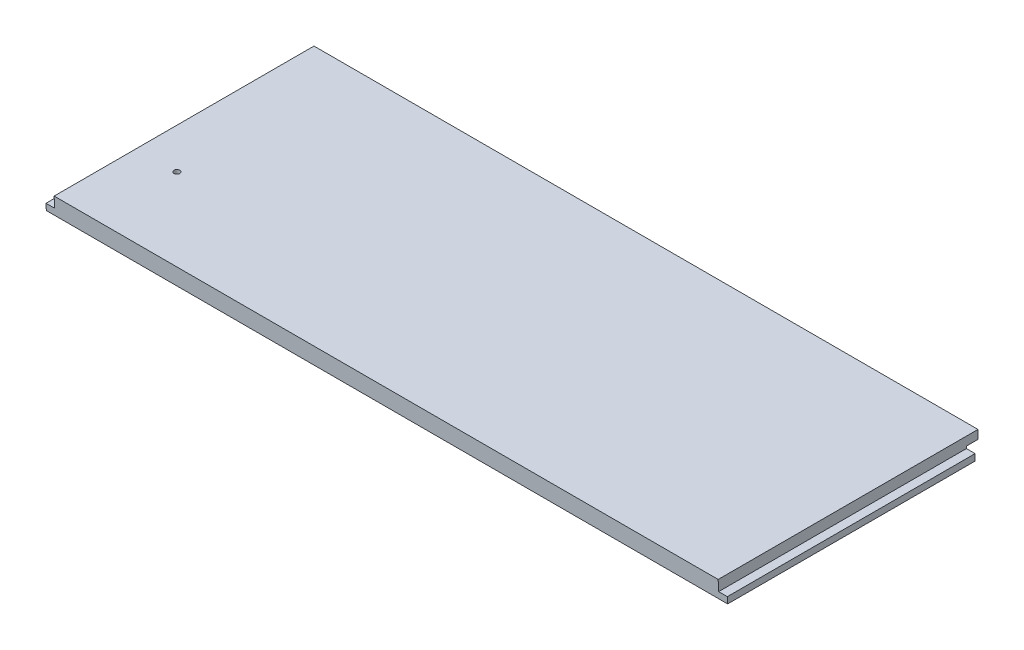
ISO-10303-21;
HEADER;
FILE_DESCRIPTION(('STEP AP214'),'2;1');
FILE_NAME('part.step','',(''),(''),'','','');
FILE_SCHEMA(('AUTOMOTIVE_DESIGN { 1 0 10303 214 1 1 1 1 }'));
ENDSEC;
DATA;
#1=APPLICATION_CONTEXT('core data for automotive mechanical design processes');
#2=APPLICATION_PROTOCOL_DEFINITION('international standard','automotive_design',2000,#1);
#3=PRODUCT_CONTEXT('',#1,'mechanical');
#4=PRODUCT('Part','Part','',(#3));
#5=PRODUCT_RELATED_PRODUCT_CATEGORY('part','',(#4));
#6=PRODUCT_DEFINITION_FORMATION('','',#4);
#7=PRODUCT_DEFINITION_CONTEXT('part definition',#1,'design');
#8=PRODUCT_DEFINITION('design','',#6,#7);
#9=PRODUCT_DEFINITION_SHAPE('','',#8);
#10=(LENGTH_UNIT() NAMED_UNIT(*) SI_UNIT(.MILLI.,.METRE.));
#11=(NAMED_UNIT(*) PLANE_ANGLE_UNIT() SI_UNIT($,.RADIAN.));
#12=(NAMED_UNIT(*) SI_UNIT($,.STERADIAN.) SOLID_ANGLE_UNIT());
#13=UNCERTAINTY_MEASURE_WITH_UNIT(LENGTH_MEASURE(1.E-05),#10,'distance_accuracy_value','');
#14=(GEOMETRIC_REPRESENTATION_CONTEXT(3) GLOBAL_UNCERTAINTY_ASSIGNED_CONTEXT((#13)) GLOBAL_UNIT_ASSIGNED_CONTEXT((#10,
#11,#12)) REPRESENTATION_CONTEXT('',''));
#15=CARTESIAN_POINT('',(0.,0.,0.));
#16=DIRECTION('',(0.,0.,1.));
#17=DIRECTION('',(1.,0.,0.));
#18=AXIS2_PLACEMENT_3D('',#15,#16,#17);
#19=CARTESIAN_POINT('',(374.65,-19.05,142.875));
#20=DIRECTION('',(1.,0.,0.));
#21=DIRECTION('',(0.,0.,-1.));
#22=AXIS2_PLACEMENT_3D('',#19,#20,#21);
#23=PLANE('',#22);
#24=DIRECTION('',(0.,-1.,0.));
#25=VECTOR('',#24,1.);
#26=CARTESIAN_POINT('',(374.65,-19.05,-130.175));
#27=LINE('',#26,#25);
#28=CARTESIAN_POINT('',(374.65,-11.90625,-130.175));
#29=VERTEX_POINT('',#28);
#30=CARTESIAN_POINT('',(374.65,-19.05,-130.175));
#31=VERTEX_POINT('',#30);
#32=EDGE_CURVE('E114',#29,#31,#27,.T.);
#33=ORIENTED_EDGE('',*,*,#32,.F.);
#34=DIRECTION('',(0.,0.,-1.));
#35=VECTOR('',#34,1.);
#36=CARTESIAN_POINT('',(374.65,-11.90625,142.875));
#37=LINE('',#36,#35);
#38=CARTESIAN_POINT('',(374.65,-11.90625,142.306746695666));
#39=VERTEX_POINT('',#38);
#40=EDGE_CURVE('E156',#39,#29,#37,.T.);
#41=ORIENTED_EDGE('',*,*,#40,.F.);
#42=DIRECTION('',(0.,-0.998862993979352,-0.0476730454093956));
#43=VECTOR('',#42,1.);
#44=CARTESIAN_POINT('',(374.65,-19.0067046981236,141.967861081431));
#45=LINE('',#44,#43);
#46=CARTESIAN_POINT('',(374.65,-19.05,141.965794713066));
#47=VERTEX_POINT('',#46);
#48=EDGE_CURVE('E145',#39,#47,#45,.T.);
#49=ORIENTED_EDGE('',*,*,#48,.T.);
#50=DIRECTION('',(0.,0.,-1.));
#51=VECTOR('',#50,1.);
#52=CARTESIAN_POINT('',(374.65,-19.05,142.875));
#53=LINE('',#52,#51);
#54=EDGE_CURVE('E135',#47,#31,#53,.T.);
#55=ORIENTED_EDGE('',*,*,#54,.T.);
#56=EDGE_LOOP('',(#33,#41,#49,#55));
#57=FACE_BOUND('',#56,.T.);
#58=ADVANCED_FACE('F33',(#57),#23,.T.);
#59=CARTESIAN_POINT('',(-374.65,-19.05,142.875));
#60=DIRECTION('',(-1.,0.,0.));
#61=DIRECTION('',(0.,0.,1.));
#62=AXIS2_PLACEMENT_3D('',#59,#60,#61);
#63=PLANE('',#62);
#64=DIRECTION('',(0.,-1.,0.));
#65=VECTOR('',#64,1.);
#66=CARTESIAN_POINT('',(-374.65,-19.05,-130.175));
#67=LINE('',#66,#65);
#68=CARTESIAN_POINT('',(-374.65,-11.90625,-130.175));
#69=VERTEX_POINT('',#68);
#70=CARTESIAN_POINT('',(-374.65,-19.05,-130.175));
#71=VERTEX_POINT('',#70);
#72=EDGE_CURVE('E111',#69,#71,#67,.T.);
#73=ORIENTED_EDGE('',*,*,#72,.T.);
#74=DIRECTION('',(0.,0.,1.));
#75=VECTOR('',#74,1.);
#76=CARTESIAN_POINT('',(-374.65,-19.05,142.875));
#77=LINE('',#76,#75);
#78=CARTESIAN_POINT('',(-374.65,-19.05,141.965794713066));
#79=VERTEX_POINT('',#78);
#80=EDGE_CURVE('E125',#71,#79,#77,.T.);
#81=ORIENTED_EDGE('',*,*,#80,.T.);
#82=DIRECTION('',(0.,0.998862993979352,0.0476730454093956));
#83=VECTOR('',#82,1.);
#84=CARTESIAN_POINT('',(-374.65,-19.0067046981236,141.967861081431));
#85=LINE('',#84,#83);
#86=CARTESIAN_POINT('',(-374.65,-11.90625,142.306746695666));
#87=VERTEX_POINT('',#86);
#88=EDGE_CURVE('E180',#79,#87,#85,.T.);
#89=ORIENTED_EDGE('',*,*,#88,.T.);
#90=DIRECTION('',(0.,0.,-1.));
#91=VECTOR('',#90,1.);
#92=CARTESIAN_POINT('',(-374.65,-11.90625,142.875));
#93=LINE('',#92,#91);
#94=EDGE_CURVE('E127',#87,#69,#93,.T.);
#95=ORIENTED_EDGE('',*,*,#94,.T.);
#96=EDGE_LOOP('',(#73,#81,#89,#95));
#97=FACE_BOUND('',#96,.T.);
#98=ADVANCED_FACE('F123',(#97),#63,.T.);
#99=CARTESIAN_POINT('',(0.,-19.05,0.));
#100=DIRECTION('',(0.,-1.,0.));
#101=DIRECTION('',(0.,0.,-1.));
#102=AXIS2_PLACEMENT_3D('',#99,#100,#101);
#103=PLANE('',#102);
#104=CARTESIAN_POINT('',(-320.675,-19.05,52.3875));
#105=DIRECTION('',(0.,1.,0.));
#106=DIRECTION('',(0.,0.,1.));
#107=AXIS2_PLACEMENT_3D('',#104,#105,#106);
#108=CIRCLE('',#107,3.17499999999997);
#109=CARTESIAN_POINT('',(-320.675,-19.05,55.5624999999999));
#110=VERTEX_POINT('',#109);
#111=EDGE_CURVE('E216',#110,#110,#108,.T.);
#112=ORIENTED_EDGE('',*,*,#111,.T.);
#113=EDGE_LOOP('',(#112));
#114=FACE_BOUND('',#113,.T.);
#115=DIRECTION('',(1.,0.,0.));
#116=VECTOR('',#115,1.);
#117=CARTESIAN_POINT('',(-374.65,-19.05,-130.175));
#118=LINE('',#117,#116);
#119=EDGE_CURVE('E108',#71,#31,#118,.T.);
#120=ORIENTED_EDGE('',*,*,#119,.T.);
#121=ORIENTED_EDGE('',*,*,#54,.F.);
#122=DIRECTION('',(-1.,0.,0.));
#123=VECTOR('',#122,1.);
#124=CARTESIAN_POINT('',(0.,-19.05,141.965794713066));
#125=LINE('',#124,#123);
#126=EDGE_CURVE('E133',#47,#79,#125,.T.);
#127=ORIENTED_EDGE('',*,*,#126,.T.);
#128=ORIENTED_EDGE('',*,*,#80,.F.);
#129=EDGE_LOOP('',(#120,#121,#127,#128));
#130=FACE_BOUND('',#129,.T.);
#131=ADVANCED_FACE('F131',(#114,#130),#103,.T.);
#132=CARTESIAN_POINT('',(-374.65,-19.05,-142.875));
#133=DIRECTION('',(0.,0.,-1.));
#134=DIRECTION('',(-1.,0.,0.));
#135=AXIS2_PLACEMENT_3D('',#132,#133,#134);
#136=PLANE('',#135);
#137=DIRECTION('',(1.,0.,0.));
#138=VECTOR('',#137,1.);
#139=CARTESIAN_POINT('',(-374.65,-9.525,-142.875));
#140=LINE('',#139,#138);
#141=CARTESIAN_POINT('',(-365.125,-9.525,-142.875));
#142=VERTEX_POINT('',#141);
#143=CARTESIAN_POINT('',(365.125,-9.525,-142.875));
#144=VERTEX_POINT('',#143);
#145=EDGE_CURVE('E128',#142,#144,#140,.T.);
#146=ORIENTED_EDGE('',*,*,#145,.F.);
#147=DIRECTION('',(0.,-1.,0.));
#148=VECTOR('',#147,1.);
#149=CARTESIAN_POINT('',(-365.125,0.,-142.875));
#150=LINE('',#149,#148);
#151=CARTESIAN_POINT('',(-365.125,0.,-142.875));
#152=VERTEX_POINT('',#151);
#153=EDGE_CURVE('E164',#152,#142,#150,.T.);
#154=ORIENTED_EDGE('',*,*,#153,.F.);
#155=DIRECTION('',(-1.,0.,0.));
#156=VECTOR('',#155,1.);
#157=CARTESIAN_POINT('',(-374.65,0.,-142.875));
#158=LINE('',#157,#156);
#159=CARTESIAN_POINT('',(365.125,0.,-142.875));
#160=VERTEX_POINT('',#159);
#161=EDGE_CURVE('E143',#160,#152,#158,.T.);
#162=ORIENTED_EDGE('',*,*,#161,.F.);
#163=DIRECTION('',(0.,1.,0.));
#164=VECTOR('',#163,1.);
#165=CARTESIAN_POINT('',(365.125,0.,-142.875));
#166=LINE('',#165,#164);
#167=EDGE_CURVE('E166',#144,#160,#166,.T.);
#168=ORIENTED_EDGE('',*,*,#167,.F.);
#169=EDGE_LOOP('',(#146,#154,#162,#168));
#170=FACE_BOUND('',#169,.T.);
#171=ADVANCED_FACE('F207',(#170),#136,.T.);
#172=CARTESIAN_POINT('',(0.,0.,0.));
#173=DIRECTION('',(0.,-1.,0.));
#174=DIRECTION('',(0.,0.,-1.));
#175=AXIS2_PLACEMENT_3D('',#172,#173,#174);
#176=PLANE('',#175);
#177=CARTESIAN_POINT('',(-320.675,0.,52.3875));
#178=DIRECTION('',(0.,1.,0.));
#179=DIRECTION('',(0.,0.,1.));
#180=AXIS2_PLACEMENT_3D('',#177,#178,#179);
#181=CIRCLE('',#180,3.17499999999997);
#182=CARTESIAN_POINT('',(-320.675,0.,55.5624999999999));
#183=VERTEX_POINT('',#182);
#184=EDGE_CURVE('E218',#183,#183,#181,.T.);
#185=ORIENTED_EDGE('',*,*,#184,.F.);
#186=EDGE_LOOP('',(#185));
#187=FACE_BOUND('',#186,.T.);
#188=DIRECTION('',(1.,0.,0.));
#189=VECTOR('',#188,1.);
#190=CARTESIAN_POINT('',(-374.65,0.,142.875));
#191=LINE('',#190,#189);
#192=CARTESIAN_POINT('',(-365.125,0.,142.875));
#193=VERTEX_POINT('',#192);
#194=CARTESIAN_POINT('',(365.125,0.,142.875));
#195=VERTEX_POINT('',#194);
#196=EDGE_CURVE('E139',#193,#195,#191,.T.);
#197=ORIENTED_EDGE('',*,*,#196,.T.);
#198=DIRECTION('',(0.,0.,-1.));
#199=VECTOR('',#198,1.);
#200=CARTESIAN_POINT('',(365.125,0.,142.875));
#201=LINE('',#200,#199);
#202=EDGE_CURVE('E161',#195,#160,#201,.T.);
#203=ORIENTED_EDGE('',*,*,#202,.T.);
#204=ORIENTED_EDGE('',*,*,#161,.T.);
#205=DIRECTION('',(0.,0.,-1.));
#206=VECTOR('',#205,1.);
#207=CARTESIAN_POINT('',(-365.125,0.,142.875));
#208=LINE('',#207,#206);
#209=EDGE_CURVE('E172',#193,#152,#208,.T.);
#210=ORIENTED_EDGE('',*,*,#209,.F.);
#211=EDGE_LOOP('',(#197,#203,#204,#210));
#212=FACE_BOUND('',#211,.T.);
#213=ADVANCED_FACE('F204',(#187,#212),#176,.F.);
#214=CARTESIAN_POINT('',(-2313.97951077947,0.,142.875));
#215=DIRECTION('',(0.,-0.0476730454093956,0.998862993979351));
#216=DIRECTION('',(0.,-0.998862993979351,-0.0476730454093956));
#217=AXIS2_PLACEMENT_3D('',#214,#215,#216);
#218=PLANE('',#217);
#219=DIRECTION('',(0.,-0.998862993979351,-0.0476730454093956));
#220=VECTOR('',#219,1.);
#221=CARTESIAN_POINT('',(365.125,0.,142.875));
#222=LINE('',#221,#220);
#223=CARTESIAN_POINT('',(365.125,-11.90625,142.306746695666));
#224=VERTEX_POINT('',#223);
#225=EDGE_CURVE('E152',#195,#224,#222,.T.);
#226=ORIENTED_EDGE('',*,*,#225,.F.);
#227=ORIENTED_EDGE('',*,*,#196,.F.);
#228=DIRECTION('',(0.,0.998862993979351,0.0476730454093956));
#229=VECTOR('',#228,1.);
#230=CARTESIAN_POINT('',(-365.125,0.,142.875));
#231=LINE('',#230,#229);
#232=CARTESIAN_POINT('',(-365.125,-11.90625,142.306746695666));
#233=VERTEX_POINT('',#232);
#234=EDGE_CURVE('E134',#233,#193,#231,.T.);
#235=ORIENTED_EDGE('',*,*,#234,.F.);
#236=DIRECTION('',(1.,0.,0.));
#237=VECTOR('',#236,1.);
#238=CARTESIAN_POINT('',(-2313.97951077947,-11.9062499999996,142.306746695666));
#239=LINE('',#238,#237);
#240=EDGE_CURVE('E137',#87,#233,#239,.T.);
#241=ORIENTED_EDGE('',*,*,#240,.F.);
#242=ORIENTED_EDGE('',*,*,#88,.F.);
#243=ORIENTED_EDGE('',*,*,#126,.F.);
#244=ORIENTED_EDGE('',*,*,#48,.F.);
#245=DIRECTION('',(1.,0.,0.));
#246=VECTOR('',#245,1.);
#247=CARTESIAN_POINT('',(-2313.97951077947,-11.90625,142.306746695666));
#248=LINE('',#247,#246);
#249=EDGE_CURVE('E150',#224,#39,#248,.T.);
#250=ORIENTED_EDGE('',*,*,#249,.F.);
#251=EDGE_LOOP('',(#226,#227,#235,#241,#242,#243,#244,#250));
#252=FACE_BOUND('',#251,.T.);
#253=ADVANCED_FACE('F184',(#252),#218,.T.);
#254=CARTESIAN_POINT('',(-374.65,-11.90625,142.875));
#255=DIRECTION('',(0.,-1.,0.));
#256=DIRECTION('',(1.,0.,0.));
#257=AXIS2_PLACEMENT_3D('',#254,#255,#256);
#258=PLANE('',#257);
#259=DIRECTION('',(0.,0.,-1.));
#260=VECTOR('',#259,1.);
#261=CARTESIAN_POINT('',(-365.125,-11.90625,142.875));
#262=LINE('',#261,#260);
#263=CARTESIAN_POINT('',(-365.125,-11.90625,-130.175));
#264=VERTEX_POINT('',#263);
#265=EDGE_CURVE('E174',#233,#264,#262,.T.);
#266=ORIENTED_EDGE('',*,*,#265,.T.);
#267=DIRECTION('',(-1.,0.,0.));
#268=VECTOR('',#267,1.);
#269=CARTESIAN_POINT('',(-374.65,-11.90625,-130.175));
#270=LINE('',#269,#268);
#271=EDGE_CURVE('E190',#264,#69,#270,.T.);
#272=ORIENTED_EDGE('',*,*,#271,.T.);
#273=ORIENTED_EDGE('',*,*,#94,.F.);
#274=ORIENTED_EDGE('',*,*,#240,.T.);
#275=EDGE_LOOP('',(#266,#272,#273,#274));
#276=FACE_BOUND('',#275,.T.);
#277=ADVANCED_FACE('F189',(#276),#258,.F.);
#278=CARTESIAN_POINT('',(-365.125,0.,142.875));
#279=DIRECTION('',(1.,0.,0.));
#280=DIRECTION('',(0.,0.,-1.));
#281=AXIS2_PLACEMENT_3D('',#278,#279,#280);
#282=PLANE('',#281);
#283=DIRECTION('',(0.,0.,1.));
#284=VECTOR('',#283,1.);
#285=CARTESIAN_POINT('',(-365.125,-9.52500000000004,142.875));
#286=LINE('',#285,#284);
#287=CARTESIAN_POINT('',(-365.125,-9.525,-130.175));
#288=VERTEX_POINT('',#287);
#289=EDGE_CURVE('E192',#142,#288,#286,.T.);
#290=ORIENTED_EDGE('',*,*,#289,.T.);
#291=DIRECTION('',(0.,-1.,0.));
#292=VECTOR('',#291,1.);
#293=CARTESIAN_POINT('',(-365.125,0.,-130.175));
#294=LINE('',#293,#292);
#295=EDGE_CURVE('E193',#288,#264,#294,.T.);
#296=ORIENTED_EDGE('',*,*,#295,.T.);
#297=ORIENTED_EDGE('',*,*,#265,.F.);
#298=ORIENTED_EDGE('',*,*,#234,.T.);
#299=ORIENTED_EDGE('',*,*,#209,.T.);
#300=ORIENTED_EDGE('',*,*,#153,.T.);
#301=EDGE_LOOP('',(#290,#296,#297,#298,#299,#300));
#302=FACE_BOUND('',#301,.T.);
#303=ADVANCED_FACE('F209',(#302),#282,.F.);
#304=CARTESIAN_POINT('',(365.125,0.,142.875));
#305=DIRECTION('',(-1.,0.,0.));
#306=DIRECTION('',(0.,0.,1.));
#307=AXIS2_PLACEMENT_3D('',#304,#305,#306);
#308=PLANE('',#307);
#309=DIRECTION('',(0.,0.,-1.));
#310=VECTOR('',#309,1.);
#311=CARTESIAN_POINT('',(365.125,-11.90625,142.875));
#312=LINE('',#311,#310);
#313=CARTESIAN_POINT('',(365.125,-11.90625,-130.175));
#314=VERTEX_POINT('',#313);
#315=EDGE_CURVE('E54',#224,#314,#312,.T.);
#316=ORIENTED_EDGE('',*,*,#315,.T.);
#317=DIRECTION('',(0.,1.,0.));
#318=VECTOR('',#317,1.);
#319=CARTESIAN_POINT('',(365.125,0.,-130.175));
#320=LINE('',#319,#318);
#321=CARTESIAN_POINT('',(365.125,-9.525,-130.175));
#322=VERTEX_POINT('',#321);
#323=EDGE_CURVE('E47',#314,#322,#320,.T.);
#324=ORIENTED_EDGE('',*,*,#323,.T.);
#325=DIRECTION('',(0.,0.,-1.));
#326=VECTOR('',#325,1.);
#327=CARTESIAN_POINT('',(365.125,-9.52500000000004,142.875));
#328=LINE('',#327,#326);
#329=EDGE_CURVE('E11',#322,#144,#328,.T.);
#330=ORIENTED_EDGE('',*,*,#329,.T.);
#331=ORIENTED_EDGE('',*,*,#167,.T.);
#332=ORIENTED_EDGE('',*,*,#202,.F.);
#333=ORIENTED_EDGE('',*,*,#225,.T.);
#334=EDGE_LOOP('',(#316,#324,#330,#331,#332,#333));
#335=FACE_BOUND('',#334,.T.);
#336=ADVANCED_FACE('F158',(#335),#308,.F.);
#337=CARTESIAN_POINT('',(374.65,-11.90625,142.875));
#338=DIRECTION('',(0.,-1.,0.));
#339=DIRECTION('',(0.,0.,-1.));
#340=AXIS2_PLACEMENT_3D('',#337,#338,#339);
#341=PLANE('',#340);
#342=ORIENTED_EDGE('',*,*,#40,.T.);
#343=DIRECTION('',(-1.,0.,0.));
#344=VECTOR('',#343,1.);
#345=CARTESIAN_POINT('',(374.65,-11.90625,-130.175));
#346=LINE('',#345,#344);
#347=EDGE_CURVE('E40',#29,#314,#346,.T.);
#348=ORIENTED_EDGE('',*,*,#347,.T.);
#349=ORIENTED_EDGE('',*,*,#315,.F.);
#350=ORIENTED_EDGE('',*,*,#249,.T.);
#351=EDGE_LOOP('',(#342,#348,#349,#350));
#352=FACE_BOUND('',#351,.T.);
#353=ADVANCED_FACE('F154',(#352),#341,.F.);
#354=CARTESIAN_POINT('',(-374.65,-9.525,-142.875));
#355=DIRECTION('',(0.,1.,0.));
#356=DIRECTION('',(0.,0.,1.));
#357=AXIS2_PLACEMENT_3D('',#354,#355,#356);
#358=PLANE('',#357);
#359=ORIENTED_EDGE('',*,*,#145,.T.);
#360=ORIENTED_EDGE('',*,*,#329,.F.);
#361=DIRECTION('',(1.,0.,0.));
#362=VECTOR('',#361,1.);
#363=CARTESIAN_POINT('',(-374.65,-9.525,-130.175));
#364=LINE('',#363,#362);
#365=EDGE_CURVE('E119',#288,#322,#364,.T.);
#366=ORIENTED_EDGE('',*,*,#365,.F.);
#367=ORIENTED_EDGE('',*,*,#289,.F.);
#368=EDGE_LOOP('',(#359,#360,#366,#367));
#369=FACE_BOUND('',#368,.T.);
#370=ADVANCED_FACE('F212',(#369),#358,.F.);
#371=CARTESIAN_POINT('',(-374.65,-19.05,-130.175));
#372=DIRECTION('',(0.,0.,1.));
#373=DIRECTION('',(1.,0.,0.));
#374=AXIS2_PLACEMENT_3D('',#371,#372,#373);
#375=PLANE('',#374);
#376=ORIENTED_EDGE('',*,*,#295,.F.);
#377=ORIENTED_EDGE('',*,*,#365,.T.);
#378=ORIENTED_EDGE('',*,*,#323,.F.);
#379=ORIENTED_EDGE('',*,*,#347,.F.);
#380=ORIENTED_EDGE('',*,*,#32,.T.);
#381=ORIENTED_EDGE('',*,*,#119,.F.);
#382=ORIENTED_EDGE('',*,*,#72,.F.);
#383=ORIENTED_EDGE('',*,*,#271,.F.);
#384=EDGE_LOOP('',(#376,#377,#378,#379,#380,#381,#382,#383));
#385=FACE_BOUND('',#384,.T.);
#386=ADVANCED_FACE('F110',(#385),#375,.F.);
#387=CARTESIAN_POINT('',(-320.675,-19.05,52.3875));
#388=DIRECTION('',(0.,1.,0.));
#389=DIRECTION('',(0.,0.,1.));
#390=AXIS2_PLACEMENT_3D('',#387,#388,#389);
#391=CYLINDRICAL_SURFACE('',#390,3.17499999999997);
#392=CARTESIAN_POINT('',(-320.675,-19.05,55.5624999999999));
#393=CARTESIAN_POINT('',(-320.675,-18.8515625,55.5624999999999));
#394=CARTESIAN_POINT('',(-320.675,-18.653125,55.5624999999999));
#395=CARTESIAN_POINT('',(-320.675,-18.25625,55.5624999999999));
#396=CARTESIAN_POINT('',(-320.675,-18.0578125,55.5624999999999));
#397=CARTESIAN_POINT('',(-320.675,-17.6609375,55.5624999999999));
#398=CARTESIAN_POINT('',(-320.675,-17.4625,55.5624999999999));
#399=CARTESIAN_POINT('',(-320.675,-17.065625,55.5624999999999));
#400=CARTESIAN_POINT('',(-320.675,-16.8671875,55.5624999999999));
#401=CARTESIAN_POINT('',(-320.675,-16.4703125,55.5624999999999));
#402=CARTESIAN_POINT('',(-320.675,-16.271875,55.5624999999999));
#403=CARTESIAN_POINT('',(-320.675,-15.875,55.5624999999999));
#404=CARTESIAN_POINT('',(-320.675,-15.6765625,55.5624999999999));
#405=CARTESIAN_POINT('',(-320.675,-15.2796875,55.5624999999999));
#406=CARTESIAN_POINT('',(-320.675,-15.08125,55.5624999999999));
#407=CARTESIAN_POINT('',(-320.675,-14.684375,55.5624999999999));
#408=CARTESIAN_POINT('',(-320.675,-14.4859375,55.5624999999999));
#409=CARTESIAN_POINT('',(-320.675,-14.0890625,55.5624999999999));
#410=CARTESIAN_POINT('',(-320.675,-13.890625,55.5624999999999));
#411=CARTESIAN_POINT('',(-320.675,-13.49375,55.5624999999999));
#412=CARTESIAN_POINT('',(-320.675,-13.2953125,55.5624999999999));
#413=CARTESIAN_POINT('',(-320.675,-12.8984375,55.5624999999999));
#414=CARTESIAN_POINT('',(-320.675,-12.7,55.5624999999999));
#415=CARTESIAN_POINT('',(-320.675,-12.303125,55.5624999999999));
#416=CARTESIAN_POINT('',(-320.675,-12.1046875,55.5624999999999));
#417=CARTESIAN_POINT('',(-320.675,-11.7078125,55.5624999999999));
#418=CARTESIAN_POINT('',(-320.675,-11.509375,55.5624999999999));
#419=CARTESIAN_POINT('',(-320.675,-11.1125,55.5624999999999));
#420=CARTESIAN_POINT('',(-320.675,-10.9140625,55.5624999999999));
#421=CARTESIAN_POINT('',(-320.675,-10.5171875,55.5624999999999));
#422=CARTESIAN_POINT('',(-320.675,-10.31875,55.5624999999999));
#423=CARTESIAN_POINT('',(-320.675,-9.921875,55.5624999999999));
#424=CARTESIAN_POINT('',(-320.675,-9.7234375,55.5624999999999));
#425=CARTESIAN_POINT('',(-320.675,-9.3265625,55.5624999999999));
#426=CARTESIAN_POINT('',(-320.675,-9.128125,55.5624999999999));
#427=CARTESIAN_POINT('',(-320.675,-8.73125,55.5624999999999));
#428=CARTESIAN_POINT('',(-320.675,-8.5328125,55.5624999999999));
#429=CARTESIAN_POINT('',(-320.675,-8.1359375,55.5624999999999));
#430=CARTESIAN_POINT('',(-320.675,-7.9375,55.5624999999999));
#431=CARTESIAN_POINT('',(-320.675,-7.540625,55.5624999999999));
#432=CARTESIAN_POINT('',(-320.675,-7.3421875,55.5624999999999));
#433=CARTESIAN_POINT('',(-320.675,-6.9453125,55.5624999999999));
#434=CARTESIAN_POINT('',(-320.675,-6.746875,55.5624999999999));
#435=CARTESIAN_POINT('',(-320.675,-6.35,55.5624999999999));
#436=CARTESIAN_POINT('',(-320.675,-6.1515625,55.5624999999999));
#437=CARTESIAN_POINT('',(-320.675,-5.7546875,55.5624999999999));
#438=CARTESIAN_POINT('',(-320.675,-5.55625,55.5624999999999));
#439=CARTESIAN_POINT('',(-320.675,-5.159375,55.5624999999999));
#440=CARTESIAN_POINT('',(-320.675,-4.9609375,55.5624999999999));
#441=CARTESIAN_POINT('',(-320.675,-4.5640625,55.5624999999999));
#442=CARTESIAN_POINT('',(-320.675,-4.365625,55.5624999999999));
#443=CARTESIAN_POINT('',(-320.675,-3.96875,55.5624999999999));
#444=CARTESIAN_POINT('',(-320.675,-3.7703125,55.5624999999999));
#445=CARTESIAN_POINT('',(-320.675,-3.3734375,55.5624999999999));
#446=CARTESIAN_POINT('',(-320.675,-3.175,55.5624999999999));
#447=CARTESIAN_POINT('',(-320.675,-2.778125,55.5624999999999));
#448=CARTESIAN_POINT('',(-320.675,-2.5796875,55.5624999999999));
#449=CARTESIAN_POINT('',(-320.675,-2.1828125,55.5624999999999));
#450=CARTESIAN_POINT('',(-320.675,-1.984375,55.5624999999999));
#451=CARTESIAN_POINT('',(-320.675,-1.5875,55.5624999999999));
#452=CARTESIAN_POINT('',(-320.675,-1.3890625,55.5624999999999));
#453=CARTESIAN_POINT('',(-320.675,-0.992187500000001,55.5624999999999));
#454=CARTESIAN_POINT('',(-320.675,-0.793750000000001,55.5624999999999));
#455=CARTESIAN_POINT('',(-320.675,-0.396875,55.5624999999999));
#456=CARTESIAN_POINT('',(-320.675,-0.1984375,55.5624999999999));
#457=CARTESIAN_POINT('',(-320.675,0.,55.5624999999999));
#458=B_SPLINE_CURVE_WITH_KNOTS('',3,(#392,#393,#394,#395,#396,#397,#398,#399,#400,#401,#402,
#403,#404,#405,#406,#407,#408,#409,#410,#411,#412,#413,#414,#415,#416,#417,#418,#419,#420,#421,
#422,#423,#424,#425,#426,#427,#428,#429,#430,#431,#432,#433,#434,#435,#436,#437,#438,#439,#440,
#441,#442,#443,#444,#445,#446,#447,#448,#449,#450,#451,#452,#453,#454,#455,#456,#457),
.UNSPECIFIED.,.F.,.F.,(4,2,2,2,2,2,2,2,2,2,2,2,2,2,2,2,2,2,2,2,2,2,2,2,2,2,2,2,2,2,2,2,4),(0.,
0.5953125,1.190625,1.7859375,2.38125,2.9765625,3.571875,4.1671875,4.7625,5.3578125,5.953125,
6.5484375,7.14375,7.7390625,8.334375,8.9296875,9.525,10.1203125,10.715625,11.3109375,11.90625,
12.5015625,13.096875,13.6921875,14.2875,14.8828125,15.478125,16.0734375,16.66875,17.2640625,
17.859375,18.4546875,19.05),.UNSPECIFIED.);
#459=EDGE_CURVE('BSEAM225',#110,#183,#458,.T.);
#460=ORIENTED_EDGE('',*,*,#111,.F.);
#461=ORIENTED_EDGE('',*,*,#184,.T.);
#462=ORIENTED_EDGE('',*,*,#459,.T.);
#463=ORIENTED_EDGE('',*,*,#459,.F.);
#464=EDGE_LOOP('',(#460,#462,#461,#463));
#465=FACE_BOUND('',#464,.T.);
#466=ADVANCED_FACE('F225',(#465),#391,.F.);
#467=CLOSED_SHELL('',(#58,#98,#131,#171,#213,#253,#277,#303,#336,#353,#370,#386,#466));
#468=MANIFOLD_SOLID_BREP('B2',#467);
#469=ADVANCED_BREP_SHAPE_REPRESENTATION('',(#18,#468),#14);
#470=SHAPE_DEFINITION_REPRESENTATION(#9,#469);
ENDSEC;
END-ISO-10303-21;
